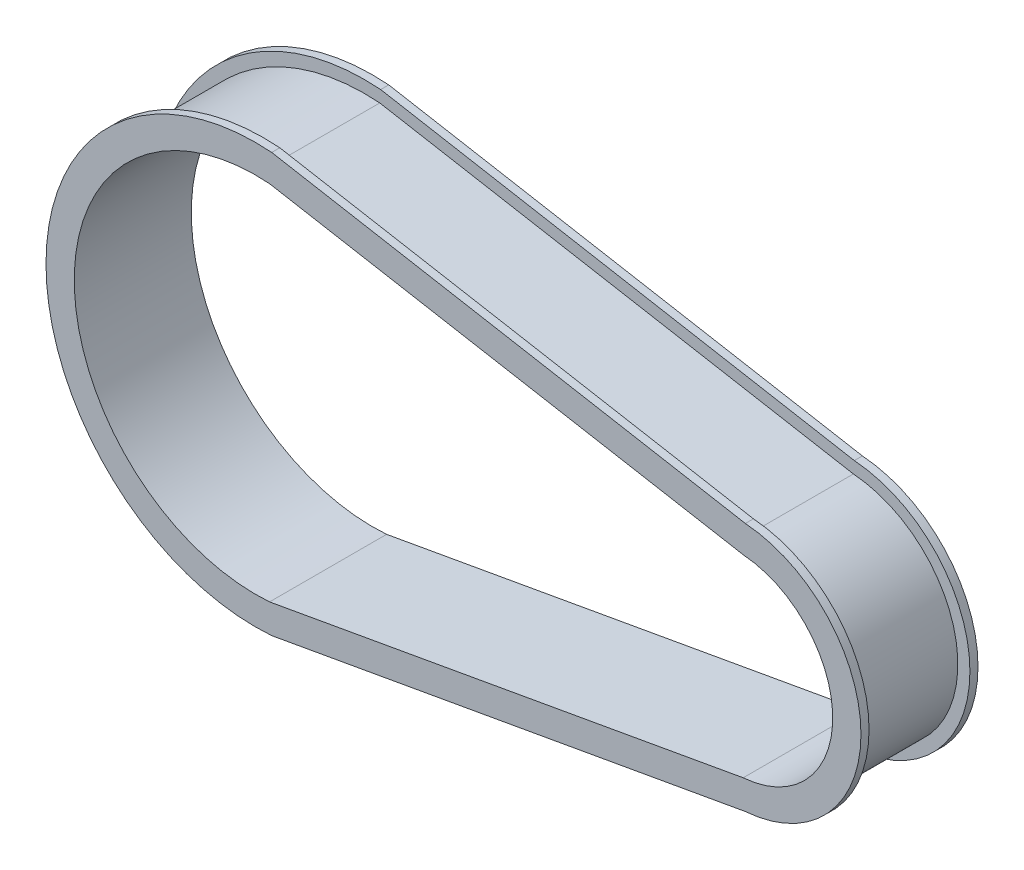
from build123d import *
from build123d.topology import SkipClean

# Parameters (mm, degrees)
EXTRUDE1_DEPTH = 6.25
EXTRUDE2_DEPTH = 0.5


with BuildPart() as part:
    # Sketch1 → Extrude1 (new body)
    with BuildSketch(Plane.XY):
        with BuildLine():
            Line((0.926782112, -12.214891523), (30.269589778, -6.979938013))
            ThreePointArc((30.269589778, -6.979938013), (36.74, 0), (30.269589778, 6.979938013))
            Line((30.269589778, 6.979938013), (0.926782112, 12.214891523))
            ThreePointArc((0.926782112, 12.214891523), (-12.25, 0), (0.926782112, -12.214891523))
        make_face()
        with BuildLine():
            Line((0.851126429, -11.217757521), (30.193934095, -5.982804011))
            ThreePointArc((30.193934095, -5.982804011), (35.74, 0), (30.193934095, 5.982804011))
            Line((30.193934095, 5.982804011), (0.851126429, 11.217757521))
            ThreePointArc((0.851126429, 11.217757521), (-11.25, 0), (0.851126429, -11.217757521))
        make_face(mode=Mode.SUBTRACT)
    extrude(amount=EXTRUDE1_DEPTH)

    # Sketch3 → Extrude2 (add)
    with SkipClean():  # the faces are left unmerged after this step: merging them gives an invalid solid
        with BuildSketch(Plane.XY.offset(6.25)):
            with BuildLine():
                Line((0.983523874, 12.962742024), (30.32633154, 7.727788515))
                ThreePointArc((30.32633154, 7.727788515), (37.49, 0), (30.32633154, -7.727788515))
                Line((30.32633154, -7.727788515), (0.983523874, -12.962742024))
                ThreePointArc((0.983523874, -12.962742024), (-13, 0), (0.983523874, 12.962742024))
            make_face()
            with BuildLine():
                Line((0.851126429, 11.217757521), (30.193934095, 5.982804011))
                ThreePointArc((30.193934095, 5.982804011), (35.74, 0), (30.193934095, -5.982804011))
                Line((30.193934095, -5.982804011), (0.851126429, -11.217757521))
                ThreePointArc((0.851126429, -11.217757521), (-11.25, 0), (0.851126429, 11.217757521))
            make_face(mode=Mode.SUBTRACT)
        extrude2 = extrude(amount=EXTRUDE2_DEPTH)

    # Mirror2: Extrude2 across plane
    with SkipClean():  # the faces are left unmerged after this step: merging them gives an invalid solid
        add(extrude2.mirror(Plane.XY.offset(3.125)))


solid = part.part
